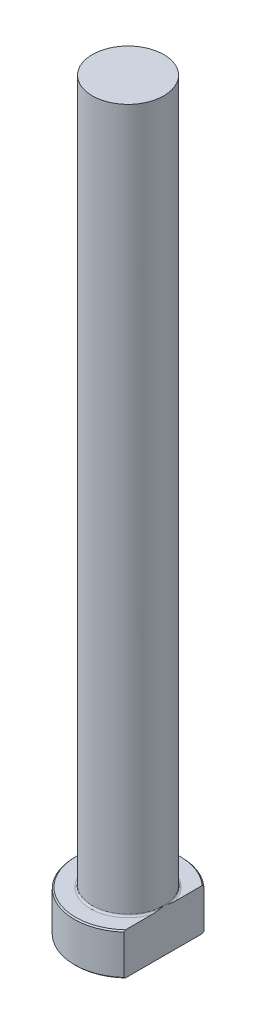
from build123d import *
from build123d.topology import SkipClean

# Parameters (mm, degrees)
CHAMFER1_SIZE = 0.2
FILLET1_R     = 0.3
KEY_DEPTH     = 126.646329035


with BuildPart() as part:
    # Sketch1 → Revolve1 (revolve)
    with BuildSketch(Plane.XY, mode=Mode.PRIVATE) as revolve1_sk:
        Polygon((0, 0), (-9, 0), (-9, 7), (-6, 7), (-6, 125), (0, 125), align=None)
    revolve(revolve1_sk.sketch.rotate(Axis((0, 259.958771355, 0), (0, -1, 0)), 270), axis=Axis((0, 259.958771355, 0), (0, -1, 0)))

    # Chamfer1
    chamfer1_edges = [part.edges().sort_by_distance(p)[0] for p in [
        (0, 7, -9),
        (0, 0, -9),
    ]]
    chamfer(chamfer1_edges, length=CHAMFER1_SIZE)

    # Fillet1
    fillet1_edges = [part.edges().sort_by_distance(p)[0] for p in [
        (0, 7, -6),
    ]]
    fillet(fillet1_edges, radius=FILLET1_R)

    # Sketch2 → KEY (cut, through all)
    with SkipClean():  # the faces are left unmerged after this step: merging them gives an invalid solid
        with BuildSketch(Plane(origin=(0, 0, 0), x_dir=(1, 0, 0), z_dir=(0, 1, 0))):
            with BuildLine():
                Line((6, 6.708203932), (6, -6.708203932))
                ThreePointArc((6, -6.708203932), (9, 0), (6, 6.708203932))
            make_face()
        extrude(amount=KEY_DEPTH, mode=Mode.SUBTRACT)


solid = part.part
